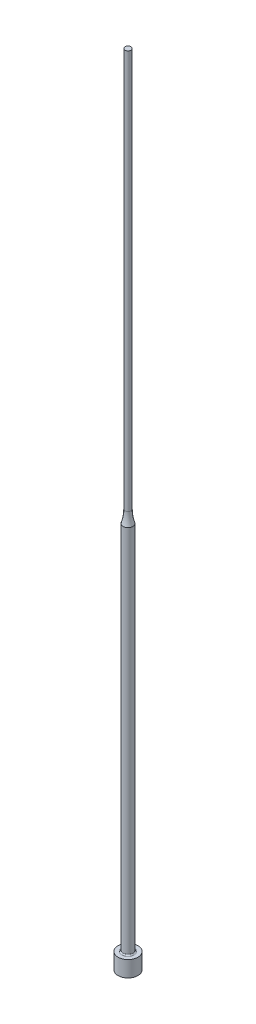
from build123d import *


with BuildPart() as part:
    # Sketch1 → Revolve1 (revolve)
    with BuildSketch(Plane.XY, mode=Mode.PRIVATE) as revolve1_sk:
        with BuildLine():
            Line((0, 0), (2.5, 0))
            Line((2.5, 0), (2.5, 4))
            Line((2.5, 4), (1.55, 4))
            ThreePointArc((1.55, 4), (1.337867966, 4.087867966), (1.25, 4.3))
            Line((1.25, 4.3), (1.25, 96.877501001))
            ThreePointArc((1.25, 96.877501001), (0.875791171, 98.41886117), (0.75, 100))
            Line((0.75, 100), (0.75, 200))
            Line((0.75, 200), (0, 200))
            Line((0, 200), (0, 0))
        make_face()
    revolve(revolve1_sk.sketch.rotate(Axis((0, 200, 0), (0, -1, 0)), 180), axis=Axis((0, 200, 0), (0, -1, 0)))


solid = part.part
